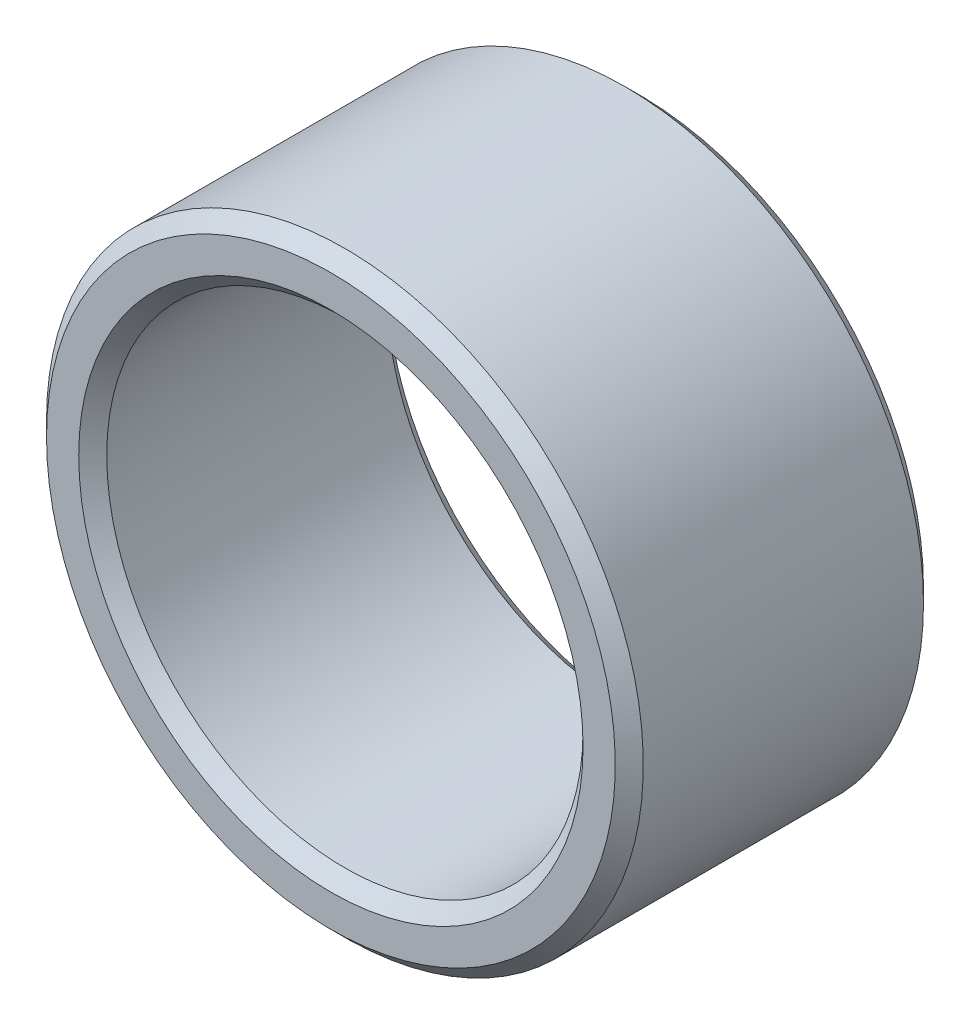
ISO-10303-21;
HEADER;
FILE_DESCRIPTION(('STEP AP214'),'2;1');
FILE_NAME('part.step','',(''),(''),'','','');
FILE_SCHEMA(('AUTOMOTIVE_DESIGN { 1 0 10303 214 1 1 1 1 }'));
ENDSEC;
DATA;
#1=APPLICATION_CONTEXT('core data for automotive mechanical design processes');
#2=APPLICATION_PROTOCOL_DEFINITION('international standard','automotive_design',2000,#1);
#3=PRODUCT_CONTEXT('',#1,'mechanical');
#4=PRODUCT('Part','Part','',(#3));
#5=PRODUCT_RELATED_PRODUCT_CATEGORY('part','',(#4));
#6=PRODUCT_DEFINITION_FORMATION('','',#4);
#7=PRODUCT_DEFINITION_CONTEXT('part definition',#1,'design');
#8=PRODUCT_DEFINITION('design','',#6,#7);
#9=PRODUCT_DEFINITION_SHAPE('','',#8);
#10=(LENGTH_UNIT() NAMED_UNIT(*) SI_UNIT(.MILLI.,.METRE.));
#11=(NAMED_UNIT(*) PLANE_ANGLE_UNIT() SI_UNIT($,.RADIAN.));
#12=(NAMED_UNIT(*) SI_UNIT($,.STERADIAN.) SOLID_ANGLE_UNIT());
#13=UNCERTAINTY_MEASURE_WITH_UNIT(LENGTH_MEASURE(1.E-05),#10,'distance_accuracy_value','');
#14=(GEOMETRIC_REPRESENTATION_CONTEXT(3) GLOBAL_UNCERTAINTY_ASSIGNED_CONTEXT((#13)) GLOBAL_UNIT_ASSIGNED_CONTEXT((#10,
#11,#12)) REPRESENTATION_CONTEXT('',''));
#15=CARTESIAN_POINT('',(0.,0.,0.));
#16=DIRECTION('',(0.,0.,1.));
#17=DIRECTION('',(1.,0.,0.));
#18=AXIS2_PLACEMENT_3D('',#15,#16,#17);
#19=CARTESIAN_POINT('',(-1.11022302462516E-13,0.,5.50000000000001));
#20=DIRECTION('',(0.,0.,-1.));
#21=DIRECTION('',(-1.,0.,0.));
#22=AXIS2_PLACEMENT_3D('',#19,#20,#21);
#23=CYLINDRICAL_SURFACE('',#22,8.5);
#24=CARTESIAN_POINT('',(0.,0.,-5.));
#25=DIRECTION('',(0.,0.,-1.));
#26=DIRECTION('',(-1.,0.,0.));
#27=AXIS2_PLACEMENT_3D('',#24,#25,#26);
#28=CIRCLE('',#27,8.5);
#29=CARTESIAN_POINT('',(-8.5,0.,-5.));
#30=VERTEX_POINT('',#29);
#31=EDGE_CURVE('E29',#30,#30,#28,.T.);
#32=ORIENTED_EDGE('',*,*,#31,.T.);
#33=EDGE_LOOP('',(#32));
#34=FACE_BOUND('',#33,.T.);
#35=CARTESIAN_POINT('',(-1.11022302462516E-13,0.,5.));
#36=DIRECTION('',(0.,0.,1.));
#37=DIRECTION('',(1.,0.,0.));
#38=AXIS2_PLACEMENT_3D('',#35,#36,#37);
#39=CIRCLE('',#38,8.5);
#40=CARTESIAN_POINT('',(8.49999999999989,0.,5.));
#41=VERTEX_POINT('',#40);
#42=EDGE_CURVE('E32',#41,#41,#39,.T.);
#43=ORIENTED_EDGE('',*,*,#42,.T.);
#44=EDGE_LOOP('',(#43));
#45=FACE_BOUND('',#44,.T.);
#46=ADVANCED_FACE('F14',(#34,#45),#23,.F.);
#47=CARTESIAN_POINT('',(-1.11022302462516E-13,0.,5.50000000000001));
#48=DIRECTION('',(0.,0.,1.));
#49=DIRECTION('',(1.,0.,0.));
#50=AXIS2_PLACEMENT_3D('',#47,#48,#49);
#51=CONICAL_SURFACE('',#50,9.,0.785398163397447);
#52=ORIENTED_EDGE('',*,*,#42,.F.);
#53=EDGE_LOOP('',(#52));
#54=FACE_BOUND('',#53,.T.);
#55=CARTESIAN_POINT('',(-1.11022302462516E-13,0.,5.50000000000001));
#56=DIRECTION('',(0.,0.,1.));
#57=DIRECTION('',(1.,0.,0.));
#58=AXIS2_PLACEMENT_3D('',#55,#56,#57);
#59=CIRCLE('',#58,9.);
#60=CARTESIAN_POINT('',(8.99999999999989,0.,5.50000000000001));
#61=VERTEX_POINT('',#60);
#62=EDGE_CURVE('E17',#61,#61,#59,.F.);
#63=ORIENTED_EDGE('',*,*,#62,.F.);
#64=EDGE_LOOP('',(#63));
#65=FACE_BOUND('',#64,.T.);
#66=ADVANCED_FACE('F48',(#54,#65),#51,.F.);
#67=CARTESIAN_POINT('',(0.,0.,-5.50000000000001));
#68=DIRECTION('',(0.,0.,-1.));
#69=DIRECTION('',(-1.,0.,0.));
#70=AXIS2_PLACEMENT_3D('',#67,#68,#69);
#71=CONICAL_SURFACE('',#70,9.00000000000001,0.785398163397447);
#72=CARTESIAN_POINT('',(0.,0.,-5.50000000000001));
#73=DIRECTION('',(0.,0.,-1.));
#74=DIRECTION('',(-1.,0.,0.));
#75=AXIS2_PLACEMENT_3D('',#72,#73,#74);
#76=CIRCLE('',#75,9.00000000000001);
#77=CARTESIAN_POINT('',(-9.00000000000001,0.,-5.50000000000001));
#78=VERTEX_POINT('',#77);
#79=EDGE_CURVE('E39',#78,#78,#76,.T.);
#80=ORIENTED_EDGE('',*,*,#79,.T.);
#81=EDGE_LOOP('',(#80));
#82=FACE_BOUND('',#81,.T.);
#83=ORIENTED_EDGE('',*,*,#31,.F.);
#84=EDGE_LOOP('',(#83));
#85=FACE_BOUND('',#84,.T.);
#86=ADVANCED_FACE('F50',(#82,#85),#71,.F.);
#87=CARTESIAN_POINT('',(-1.11022302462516E-13,0.,5.50000000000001));
#88=DIRECTION('',(0.,0.,1.));
#89=DIRECTION('',(1.,0.,0.));
#90=AXIS2_PLACEMENT_3D('',#87,#88,#89);
#91=PLANE('',#90);
#92=CARTESIAN_POINT('',(-1.11022302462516E-13,0.,5.50000000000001));
#93=DIRECTION('',(0.,0.,-1.));
#94=DIRECTION('',(-1.,0.,0.));
#95=AXIS2_PLACEMENT_3D('',#92,#93,#94);
#96=CIRCLE('',#95,10.15);
#97=CARTESIAN_POINT('',(-10.1500000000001,0.,5.50000000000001));
#98=VERTEX_POINT('',#97);
#99=EDGE_CURVE('E37',#98,#98,#96,.T.);
#100=ORIENTED_EDGE('',*,*,#99,.F.);
#101=EDGE_LOOP('',(#100));
#102=FACE_BOUND('',#101,.T.);
#103=ORIENTED_EDGE('',*,*,#62,.T.);
#104=EDGE_LOOP('',(#103));
#105=FACE_BOUND('',#104,.T.);
#106=ADVANCED_FACE('F46',(#102,#105),#91,.T.);
#107=CARTESIAN_POINT('',(0.,0.,-5.50000000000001));
#108=DIRECTION('',(0.,0.,1.));
#109=DIRECTION('',(1.,0.,0.));
#110=AXIS2_PLACEMENT_3D('',#107,#108,#109);
#111=PLANE('',#110);
#112=CARTESIAN_POINT('',(0.,0.,-5.50000000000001));
#113=DIRECTION('',(0.,0.,1.));
#114=DIRECTION('',(1.,0.,0.));
#115=AXIS2_PLACEMENT_3D('',#112,#113,#114);
#116=CIRCLE('',#115,10.15);
#117=CARTESIAN_POINT('',(10.15,0.,-5.50000000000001));
#118=VERTEX_POINT('',#117);
#119=EDGE_CURVE('E26',#118,#118,#116,.T.);
#120=ORIENTED_EDGE('',*,*,#119,.F.);
#121=EDGE_LOOP('',(#120));
#122=FACE_BOUND('',#121,.T.);
#123=ORIENTED_EDGE('',*,*,#79,.F.);
#124=EDGE_LOOP('',(#123));
#125=FACE_BOUND('',#124,.T.);
#126=ADVANCED_FACE('F74',(#122,#125),#111,.F.);
#127=CARTESIAN_POINT('',(-1.11022302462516E-13,0.,5.));
#128=DIRECTION('',(0.,0.,-1.));
#129=DIRECTION('',(-1.,0.,0.));
#130=AXIS2_PLACEMENT_3D('',#127,#128,#129);
#131=CONICAL_SURFACE('',#130,10.65,0.785398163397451);
#132=CARTESIAN_POINT('',(-1.11022302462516E-13,0.,5.));
#133=DIRECTION('',(0.,0.,-1.));
#134=DIRECTION('',(-1.,0.,0.));
#135=AXIS2_PLACEMENT_3D('',#132,#133,#134);
#136=CIRCLE('',#135,10.65);
#137=CARTESIAN_POINT('',(-10.6500000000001,0.,5.));
#138=VERTEX_POINT('',#137);
#139=EDGE_CURVE('E21',#138,#138,#136,.T.);
#140=ORIENTED_EDGE('',*,*,#139,.F.);
#141=EDGE_LOOP('',(#140));
#142=FACE_BOUND('',#141,.T.);
#143=ORIENTED_EDGE('',*,*,#99,.T.);
#144=EDGE_LOOP('',(#143));
#145=FACE_BOUND('',#144,.T.);
#146=ADVANCED_FACE('F67',(#142,#145),#131,.T.);
#147=CARTESIAN_POINT('',(0.,0.,-5.));
#148=DIRECTION('',(0.,0.,1.));
#149=DIRECTION('',(1.,0.,0.));
#150=AXIS2_PLACEMENT_3D('',#147,#148,#149);
#151=CONICAL_SURFACE('',#150,10.65,0.78539816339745);
#152=CARTESIAN_POINT('',(0.,0.,-5.));
#153=DIRECTION('',(0.,0.,-1.));
#154=DIRECTION('',(-1.,0.,0.));
#155=AXIS2_PLACEMENT_3D('',#152,#153,#154);
#156=CIRCLE('',#155,10.65);
#157=CARTESIAN_POINT('',(-10.65,0.,-5.));
#158=VERTEX_POINT('',#157);
#159=EDGE_CURVE('E10',#158,#158,#156,.F.);
#160=ORIENTED_EDGE('',*,*,#159,.F.);
#161=EDGE_LOOP('',(#160));
#162=FACE_BOUND('',#161,.T.);
#163=ORIENTED_EDGE('',*,*,#119,.T.);
#164=EDGE_LOOP('',(#163));
#165=FACE_BOUND('',#164,.T.);
#166=ADVANCED_FACE('F62',(#162,#165),#151,.T.);
#167=CARTESIAN_POINT('',(-1.11022302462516E-13,0.,5.50000000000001));
#168=DIRECTION('',(0.,0.,-1.));
#169=DIRECTION('',(-1.,0.,0.));
#170=AXIS2_PLACEMENT_3D('',#167,#168,#169);
#171=CYLINDRICAL_SURFACE('',#170,10.65);
#172=ORIENTED_EDGE('',*,*,#159,.T.);
#173=EDGE_LOOP('',(#172));
#174=FACE_BOUND('',#173,.T.);
#175=ORIENTED_EDGE('',*,*,#139,.T.);
#176=EDGE_LOOP('',(#175));
#177=FACE_BOUND('',#176,.T.);
#178=ADVANCED_FACE('F60',(#174,#177),#171,.T.);
#179=CLOSED_SHELL('',(#46,#66,#86,#106,#126,#146,#166,#178));
#180=MANIFOLD_SOLID_BREP('B1',#179);
#181=ADVANCED_BREP_SHAPE_REPRESENTATION('',(#18,#180),#14);
#182=SHAPE_DEFINITION_REPRESENTATION(#9,#181);
ENDSEC;
END-ISO-10303-21;
